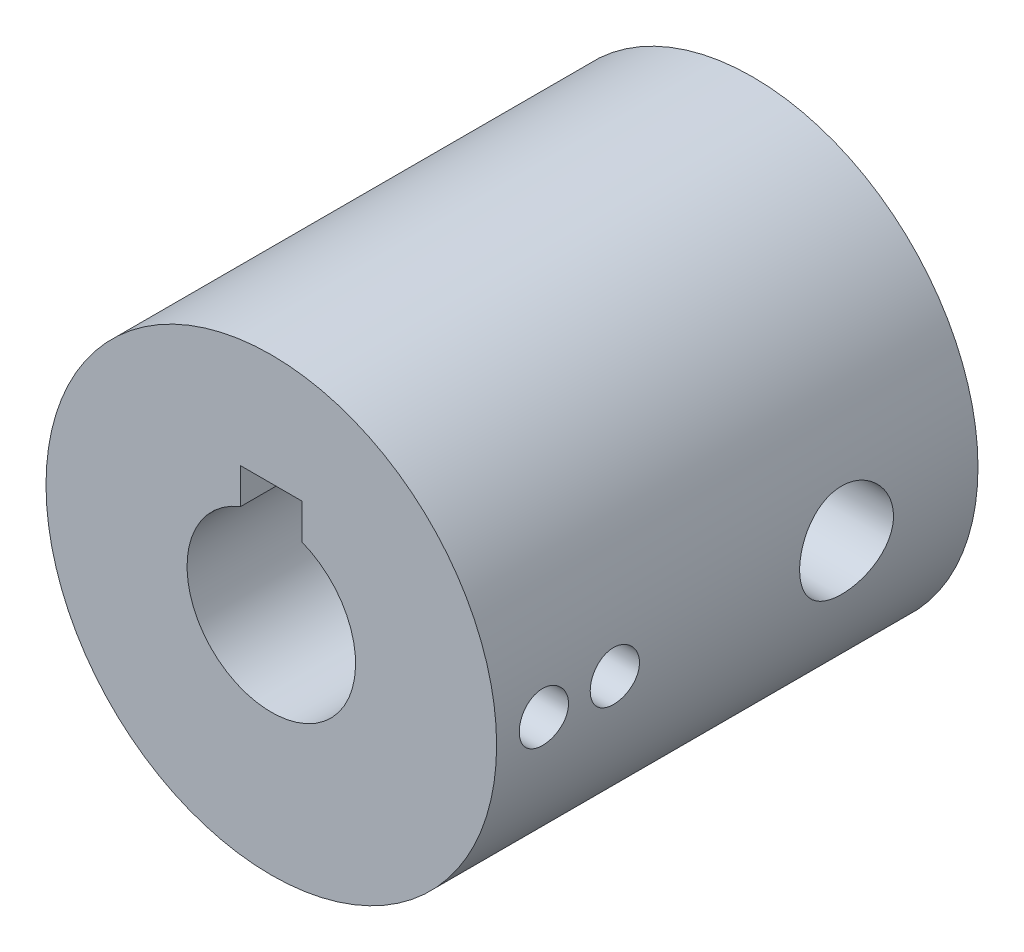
from build123d import *

# Parameters (mm, degrees)
SKETCH2_R           = 19.05
BOSS_EXTRUDE1_DEPTH = 28
SKETCH3_R           = 19.05
BOSS_EXTRUDE2_DEPTH = 12.7
CUT_EXTRUDE1_DEPTH  = 49.80875946
SKETCH6_R           = 3.96875
SKETCH6_R_2         = 2.083
CUT_EXTRUDE3_DEPTH  = 28.194


with BuildPart() as part:
    # Sketch2 → Boss-Extrude1 (new body)
    with BuildSketch(Plane.XY):
        Circle(SKETCH2_R)
    extrude(amount=BOSS_EXTRUDE1_DEPTH)

    # Sketch3 → Boss-Extrude2 (add)
    with BuildSketch(Plane.XY.offset(28)):
        Circle(SKETCH3_R)
    extrude(amount=BOSS_EXTRUDE2_DEPTH)

    # Sketch4 → Cut-Extrude1 (cut, through all)
    with BuildSketch(Plane(origin=(0, 0, 0), x_dir=(-1, 0, 0), z_dir=(0, 0, -1))):
        with BuildLine():
            Line((-2.6, 6.633673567), (-2.6, 9.633673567))
            Line((-2.6, 9.633673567), (2.6, 9.633673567))
            Line((2.6, 9.633673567), (2.6, 6.633673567))
            ThreePointArc((2.6, 6.633673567), (0, -7.125), (-2.6, 6.633673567))
        make_face()
    extrude(amount=-CUT_EXTRUDE1_DEPTH, mode=Mode.SUBTRACT)

    # Sketch6 → Cut-Extrude3 (cut)
    with BuildSketch(Plane(origin=(0, 0, 0), x_dir=(0, 0, -1), z_dir=(1, 0, 0))):
        with Locations(Location((-11.1125, 0, 0), (0, 0, 180))):
            Circle(SKETCH6_R)
        with Locations(Location((-36.70369914, 0, 0), (0, 0, 180))):
            Circle(SKETCH6_R_2)
        with Locations(Location((-30.70369914, 0, 0), (0, 0, 180))):
            Circle(SKETCH6_R_2)
    extrude(amount=CUT_EXTRUDE3_DEPTH, mode=Mode.SUBTRACT)


solid = part.part
